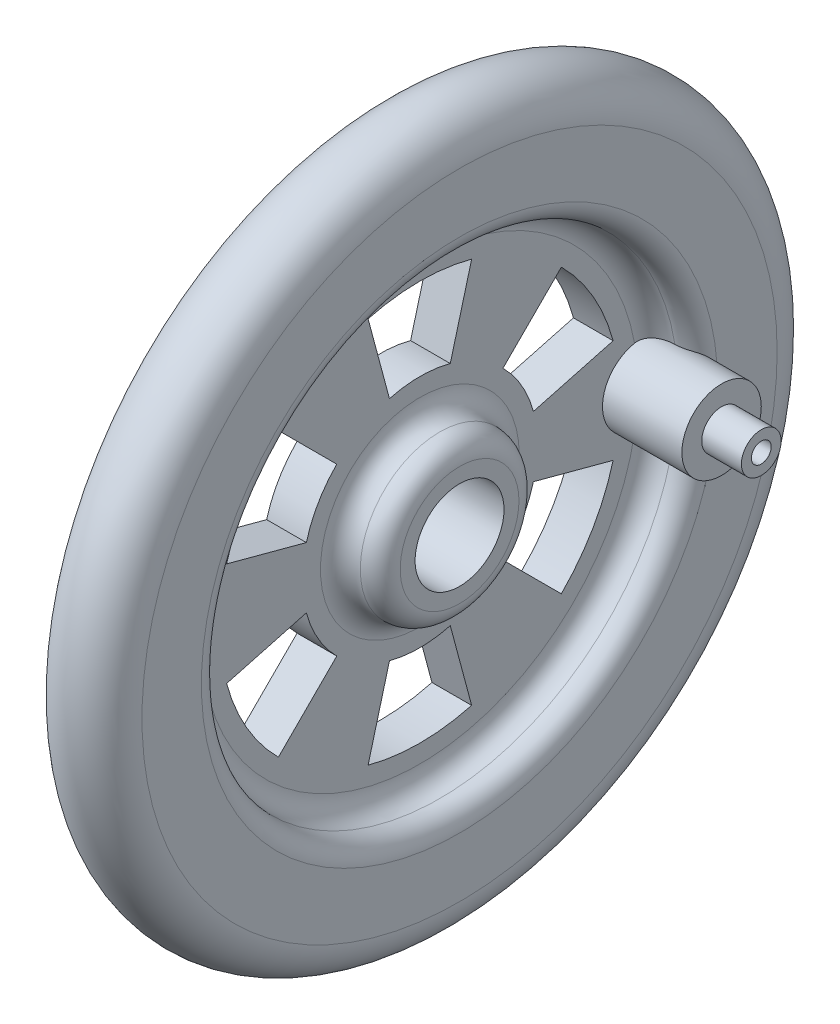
ISO-10303-21;
HEADER;
FILE_DESCRIPTION(('STEP AP214'),'2;1');
FILE_NAME('part.step','',(''),(''),'','','');
FILE_SCHEMA(('AUTOMOTIVE_DESIGN { 1 0 10303 214 1 1 1 1 }'));
ENDSEC;
DATA;
#1=APPLICATION_CONTEXT('core data for automotive mechanical design processes');
#2=APPLICATION_PROTOCOL_DEFINITION('international standard','automotive_design',2000,#1);
#3=PRODUCT_CONTEXT('',#1,'mechanical');
#4=PRODUCT('Part','Part','',(#3));
#5=PRODUCT_RELATED_PRODUCT_CATEGORY('part','',(#4));
#6=PRODUCT_DEFINITION_FORMATION('','',#4);
#7=PRODUCT_DEFINITION_CONTEXT('part definition',#1,'design');
#8=PRODUCT_DEFINITION('design','',#6,#7);
#9=PRODUCT_DEFINITION_SHAPE('','',#8);
#10=(LENGTH_UNIT() NAMED_UNIT(*) SI_UNIT(.MILLI.,.METRE.));
#11=(NAMED_UNIT(*) PLANE_ANGLE_UNIT() SI_UNIT($,.RADIAN.));
#12=(NAMED_UNIT(*) SI_UNIT($,.STERADIAN.) SOLID_ANGLE_UNIT());
#13=UNCERTAINTY_MEASURE_WITH_UNIT(LENGTH_MEASURE(1.E-05),#10,'distance_accuracy_value','');
#14=(GEOMETRIC_REPRESENTATION_CONTEXT(3) GLOBAL_UNCERTAINTY_ASSIGNED_CONTEXT((#13)) GLOBAL_UNIT_ASSIGNED_CONTEXT((#10,
#11,#12)) REPRESENTATION_CONTEXT('',''));
#15=CARTESIAN_POINT('',(0.,0.,0.));
#16=DIRECTION('',(0.,0.,1.));
#17=DIRECTION('',(1.,0.,0.));
#18=AXIS2_PLACEMENT_3D('',#15,#16,#17);
#19=CARTESIAN_POINT('',(9.525,0.,-17.78));
#20=DIRECTION('',(1.,0.,0.));
#21=DIRECTION('',(0.,0.,-1.));
#22=AXIS2_PLACEMENT_3D('',#19,#20,#21);
#23=PLANE('',#22);
#24=CARTESIAN_POINT('',(9.525,0.,-17.78));
#25=DIRECTION('',(1.,0.,0.));
#26=DIRECTION('',(0.,0.,-1.));
#27=AXIS2_PLACEMENT_3D('',#24,#25,#26);
#28=CIRCLE('',#27,3.175);
#29=CARTESIAN_POINT('',(9.525,0.,-20.955));
#30=VERTEX_POINT('',#29);
#31=EDGE_CURVE('E222',#30,#30,#28,.T.);
#32=ORIENTED_EDGE('',*,*,#31,.T.);
#33=EDGE_LOOP('',(#32));
#34=FACE_BOUND('',#33,.T.);
#35=CARTESIAN_POINT('',(9.525,0.,-17.78));
#36=DIRECTION('',(1.,0.,0.));
#37=DIRECTION('',(0.,0.,-1.));
#38=AXIS2_PLACEMENT_3D('',#35,#36,#37);
#39=CIRCLE('',#38,1.5875);
#40=CARTESIAN_POINT('',(9.525,0.,-19.3675));
#41=VERTEX_POINT('',#40);
#42=EDGE_CURVE('E509',#41,#41,#39,.T.);
#43=ORIENTED_EDGE('',*,*,#42,.F.);
#44=EDGE_LOOP('',(#43));
#45=FACE_BOUND('',#44,.T.);
#46=ADVANCED_FACE('F31',(#34,#45),#23,.T.);
#47=CARTESIAN_POINT('',(6.35,0.,0.));
#48=DIRECTION('',(1.,0.,0.));
#49=DIRECTION('',(0.,0.,-1.));
#50=AXIS2_PLACEMENT_3D('',#47,#48,#49);
#51=PLANE('',#50);
#52=CARTESIAN_POINT('',(6.35,0.,0.));
#53=DIRECTION('',(1.,0.,0.));
#54=DIRECTION('',(0.,0.,-1.));
#55=AXIS2_PLACEMENT_3D('',#52,#53,#54);
#56=CIRCLE('',#55,25.4);
#57=CARTESIAN_POINT('',(6.35,0.,-25.4));
#58=VERTEX_POINT('',#57);
#59=EDGE_CURVE('E474',#58,#58,#56,.T.);
#60=ORIENTED_EDGE('',*,*,#59,.T.);
#61=EDGE_LOOP('',(#60));
#62=FACE_BOUND('',#61,.T.);
#63=CARTESIAN_POINT('',(6.35,0.,0.));
#64=DIRECTION('',(1.,0.,0.));
#65=DIRECTION('',(0.,0.,-1.));
#66=AXIS2_PLACEMENT_3D('',#63,#64,#65);
#67=CIRCLE('',#66,20.650099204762);
#68=CARTESIAN_POINT('',(6.35,-1.46218893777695,-20.5982669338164));
#69=VERTEX_POINT('',#68);
#70=CARTESIAN_POINT('',(6.35,1.46218893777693,-20.5982669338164));
#71=VERTEX_POINT('',#70);
#72=EDGE_CURVE('E244',#69,#71,#67,.F.);
#73=ORIENTED_EDGE('',*,*,#72,.T.);
#74=CARTESIAN_POINT('',(6.35,0.,-17.78));
#75=DIRECTION('',(1.,0.,0.));
#76=DIRECTION('',(0.,0.,-1.));
#77=AXIS2_PLACEMENT_3D('',#74,#75,#76);
#78=CIRCLE('',#77,3.175);
#79=EDGE_CURVE('E51',#71,#69,#78,.F.);
#80=ORIENTED_EDGE('',*,*,#79,.T.);
#81=EDGE_LOOP('',(#73,#80));
#82=FACE_BOUND('',#81,.T.);
#83=ADVANCED_FACE('F497',(#62,#82),#51,.T.);
#84=CARTESIAN_POINT('',(3.175,0.,0.));
#85=DIRECTION('',(1.,0.,0.));
#86=DIRECTION('',(0.,0.,-1.));
#87=AXIS2_PLACEMENT_3D('',#84,#85,#86);
#88=PLANE('',#87);
#89=CARTESIAN_POINT('',(3.175,0.,0.));
#90=DIRECTION('',(1.,0.,0.));
#91=DIRECTION('',(0.,0.,-1.));
#92=AXIS2_PLACEMENT_3D('',#89,#90,#91);
#93=CIRCLE('',#92,7.95009920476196);
#94=CARTESIAN_POINT('',(3.175,0.,-7.95009920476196));
#95=VERTEX_POINT('',#94);
#96=EDGE_CURVE('E233',#95,#95,#93,.F.);
#97=ORIENTED_EDGE('',*,*,#96,.T.);
#98=EDGE_LOOP('',(#97));
#99=FACE_BOUND('',#98,.T.);
#100=CARTESIAN_POINT('',(3.175,0.,0.));
#101=DIRECTION('',(-1.,0.,0.));
#102=DIRECTION('',(0.,0.,-1.));
#103=AXIS2_PLACEMENT_3D('',#100,#101,#102);
#104=CIRCLE('',#103,9.398);
#105=CARTESIAN_POINT('',(3.175,6.64538952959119,-6.64538952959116));
#106=VERTEX_POINT('',#105);
#107=CARTESIAN_POINT('',(3.175,2.4323813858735,-9.07777091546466));
#108=VERTEX_POINT('',#107);
#109=EDGE_CURVE('E432',#106,#108,#104,.T.);
#110=ORIENTED_EDGE('',*,*,#109,.F.);
#111=DIRECTION('',(0.,-0.707106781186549,0.707106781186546));
#112=VECTOR('',#111,1.);
#113=CARTESIAN_POINT('',(3.175,6.64538952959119,-6.64538952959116));
#114=LINE('',#113,#112);
#115=CARTESIAN_POINT('',(3.175,11.3151227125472,-11.3151227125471));
#116=VERTEX_POINT('',#115);
#117=EDGE_CURVE('E443',#116,#106,#114,.T.);
#118=ORIENTED_EDGE('',*,*,#117,.F.);
#119=CARTESIAN_POINT('',(3.175,0.,0.));
#120=DIRECTION('',(1.,0.,0.));
#121=DIRECTION('',(0.,0.,-1.));
#122=AXIS2_PLACEMENT_3D('',#119,#120,#121);
#123=CIRCLE('',#122,16.002);
#124=CARTESIAN_POINT('',(3.175,4.14162235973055,-15.4567450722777));
#125=VERTEX_POINT('',#124);
#126=EDGE_CURVE('E457',#125,#116,#123,.T.);
#127=ORIENTED_EDGE('',*,*,#126,.F.);
#128=DIRECTION('',(0.,0.258819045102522,-0.965925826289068));
#129=VECTOR('',#128,1.);
#130=CARTESIAN_POINT('',(3.175,2.4323813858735,-9.07777091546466));
#131=LINE('',#130,#129);
#132=EDGE_CURVE('E454',#108,#125,#131,.T.);
#133=ORIENTED_EDGE('',*,*,#132,.F.);
#134=EDGE_LOOP('',(#110,#118,#127,#133));
#135=FACE_BOUND('',#134,.T.);
#136=CARTESIAN_POINT('',(3.175,0.,0.));
#137=DIRECTION('',(-1.,0.,0.));
#138=DIRECTION('',(0.,0.86602540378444,-0.499999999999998));
#139=AXIS2_PLACEMENT_3D('',#136,#137,#138);
#140=CIRCLE('',#139,9.398);
#141=CARTESIAN_POINT('',(3.175,9.07777091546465,2.43238138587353));
#142=VERTEX_POINT('',#141);
#143=CARTESIAN_POINT('',(3.175,9.07777091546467,-2.43238138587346));
#144=VERTEX_POINT('',#143);
#145=EDGE_CURVE('E400',#142,#144,#140,.T.);
#146=ORIENTED_EDGE('',*,*,#145,.F.);
#147=DIRECTION('',(0.,-0.965925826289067,-0.258819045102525));
#148=VECTOR('',#147,1.);
#149=CARTESIAN_POINT('',(3.175,9.07777091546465,2.43238138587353));
#150=LINE('',#149,#148);
#151=CARTESIAN_POINT('',(3.175,15.4567450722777,4.14162235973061));
#152=VERTEX_POINT('',#151);
#153=EDGE_CURVE('E411',#152,#142,#150,.T.);
#154=ORIENTED_EDGE('',*,*,#153,.F.);
#155=CARTESIAN_POINT('',(3.175,0.,0.));
#156=DIRECTION('',(1.,0.,0.));
#157=DIRECTION('',(0.,0.86602540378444,-0.499999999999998));
#158=AXIS2_PLACEMENT_3D('',#155,#156,#157);
#159=CIRCLE('',#158,16.002);
#160=CARTESIAN_POINT('',(3.175,15.4567450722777,-4.14162235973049));
#161=VERTEX_POINT('',#160);
#162=EDGE_CURVE('E425',#161,#152,#159,.T.);
#163=ORIENTED_EDGE('',*,*,#162,.F.);
#164=DIRECTION('',(0.,0.965925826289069,-0.258819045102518));
#165=VECTOR('',#164,1.);
#166=CARTESIAN_POINT('',(3.175,9.07777091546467,-2.43238138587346));
#167=LINE('',#166,#165);
#168=EDGE_CURVE('E422',#144,#161,#167,.T.);
#169=ORIENTED_EDGE('',*,*,#168,.F.);
#170=EDGE_LOOP('',(#146,#154,#163,#169));
#171=FACE_BOUND('',#170,.T.);
#172=CARTESIAN_POINT('',(3.175,0.,0.));
#173=DIRECTION('',(-1.,0.,0.));
#174=DIRECTION('',(0.,0.866025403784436,0.500000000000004));
#175=AXIS2_PLACEMENT_3D('',#172,#173,#174);
#176=CIRCLE('',#175,9.398);
#177=CARTESIAN_POINT('',(3.175,2.43238138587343,9.07777091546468));
#178=VERTEX_POINT('',#177);
#179=CARTESIAN_POINT('',(3.175,6.64538952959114,6.64538952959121));
#180=VERTEX_POINT('',#179);
#181=EDGE_CURVE('E368',#178,#180,#176,.T.);
#182=ORIENTED_EDGE('',*,*,#181,.F.);
#183=DIRECTION('',(0.,-0.258819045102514,-0.96592582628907));
#184=VECTOR('',#183,1.);
#185=CARTESIAN_POINT('',(3.175,2.43238138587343,9.07777091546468));
#186=LINE('',#185,#184);
#187=CARTESIAN_POINT('',(3.175,4.14162235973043,15.4567450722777));
#188=VERTEX_POINT('',#187);
#189=EDGE_CURVE('E379',#188,#178,#186,.T.);
#190=ORIENTED_EDGE('',*,*,#189,.F.);
#191=CARTESIAN_POINT('',(3.175,0.,0.));
#192=DIRECTION('',(1.,0.,0.));
#193=DIRECTION('',(0.,0.866025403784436,0.500000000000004));
#194=AXIS2_PLACEMENT_3D('',#191,#192,#193);
#195=CIRCLE('',#194,16.002);
#196=CARTESIAN_POINT('',(3.175,11.3151227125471,11.3151227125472));
#197=VERTEX_POINT('',#196);
#198=EDGE_CURVE('E393',#197,#188,#195,.T.);
#199=ORIENTED_EDGE('',*,*,#198,.F.);
#200=DIRECTION('',(0.,0.707106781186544,0.707106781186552));
#201=VECTOR('',#200,1.);
#202=CARTESIAN_POINT('',(3.175,6.64538952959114,6.64538952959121));
#203=LINE('',#202,#201);
#204=EDGE_CURVE('E390',#180,#197,#203,.T.);
#205=ORIENTED_EDGE('',*,*,#204,.F.);
#206=EDGE_LOOP('',(#182,#190,#199,#205));
#207=FACE_BOUND('',#206,.T.);
#208=CARTESIAN_POINT('',(3.175,0.,0.));
#209=DIRECTION('',(-1.,0.,0.));
#210=DIRECTION('',(0.,0.,1.));
#211=AXIS2_PLACEMENT_3D('',#208,#209,#210);
#212=CIRCLE('',#211,9.398);
#213=CARTESIAN_POINT('',(3.175,-6.64538952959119,6.64538952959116));
#214=VERTEX_POINT('',#213);
#215=CARTESIAN_POINT('',(3.175,-2.4323813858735,9.07777091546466));
#216=VERTEX_POINT('',#215);
#217=EDGE_CURVE('E336',#214,#216,#212,.T.);
#218=ORIENTED_EDGE('',*,*,#217,.F.);
#219=DIRECTION('',(0.,0.707106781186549,-0.707106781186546));
#220=VECTOR('',#219,1.);
#221=CARTESIAN_POINT('',(3.175,-6.64538952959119,6.64538952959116));
#222=LINE('',#221,#220);
#223=CARTESIAN_POINT('',(3.175,-11.3151227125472,11.3151227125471));
#224=VERTEX_POINT('',#223);
#225=EDGE_CURVE('E347',#224,#214,#222,.T.);
#226=ORIENTED_EDGE('',*,*,#225,.F.);
#227=CARTESIAN_POINT('',(3.175,0.,0.));
#228=DIRECTION('',(1.,0.,0.));
#229=DIRECTION('',(0.,0.,1.));
#230=AXIS2_PLACEMENT_3D('',#227,#228,#229);
#231=CIRCLE('',#230,16.002);
#232=CARTESIAN_POINT('',(3.175,-4.14162235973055,15.4567450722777));
#233=VERTEX_POINT('',#232);
#234=EDGE_CURVE('E361',#233,#224,#231,.T.);
#235=ORIENTED_EDGE('',*,*,#234,.F.);
#236=DIRECTION('',(0.,-0.258819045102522,0.965925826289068));
#237=VECTOR('',#236,1.);
#238=CARTESIAN_POINT('',(3.175,-2.4323813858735,9.07777091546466));
#239=LINE('',#238,#237);
#240=EDGE_CURVE('E358',#216,#233,#239,.T.);
#241=ORIENTED_EDGE('',*,*,#240,.F.);
#242=EDGE_LOOP('',(#218,#226,#235,#241));
#243=FACE_BOUND('',#242,.T.);
#244=CARTESIAN_POINT('',(3.175,0.,0.));
#245=DIRECTION('',(-1.,0.,0.));
#246=DIRECTION('',(0.,-0.866025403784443,0.499999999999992));
#247=AXIS2_PLACEMENT_3D('',#244,#245,#246);
#248=CIRCLE('',#247,9.398);
#249=CARTESIAN_POINT('',(3.175,-9.07777091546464,-2.43238138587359));
#250=VERTEX_POINT('',#249);
#251=CARTESIAN_POINT('',(3.175,-9.07777091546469,2.4323813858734));
#252=VERTEX_POINT('',#251);
#253=EDGE_CURVE('E304',#250,#252,#248,.T.);
#254=ORIENTED_EDGE('',*,*,#253,.F.);
#255=DIRECTION('',(0.,0.965925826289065,0.258819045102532));
#256=VECTOR('',#255,1.);
#257=CARTESIAN_POINT('',(3.175,-9.07777091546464,-2.43238138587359));
#258=LINE('',#257,#256);
#259=CARTESIAN_POINT('',(3.175,-15.4567450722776,-4.14162235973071));
#260=VERTEX_POINT('',#259);
#261=EDGE_CURVE('E315',#260,#250,#258,.T.);
#262=ORIENTED_EDGE('',*,*,#261,.F.);
#263=CARTESIAN_POINT('',(3.175,0.,0.));
#264=DIRECTION('',(1.,0.,0.));
#265=DIRECTION('',(0.,-0.866025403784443,0.499999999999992));
#266=AXIS2_PLACEMENT_3D('',#263,#264,#265);
#267=CIRCLE('',#266,16.002);
#268=CARTESIAN_POINT('',(3.175,-15.4567450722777,4.14162235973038));
#269=VERTEX_POINT('',#268);
#270=EDGE_CURVE('E329',#269,#260,#267,.T.);
#271=ORIENTED_EDGE('',*,*,#270,.F.);
#272=DIRECTION('',(0.,-0.965925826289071,0.258819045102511));
#273=VECTOR('',#272,1.);
#274=CARTESIAN_POINT('',(3.175,-9.07777091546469,2.4323813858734));
#275=LINE('',#274,#273);
#276=EDGE_CURVE('E326',#252,#269,#275,.T.);
#277=ORIENTED_EDGE('',*,*,#276,.F.);
#278=EDGE_LOOP('',(#254,#262,#271,#277));
#279=FACE_BOUND('',#278,.T.);
#280=CARTESIAN_POINT('',(3.175,0.,0.));
#281=DIRECTION('',(-1.,0.,0.));
#282=DIRECTION('',(0.,-0.866025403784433,-0.50000000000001));
#283=AXIS2_PLACEMENT_3D('',#280,#281,#282);
#284=CIRCLE('',#283,9.398);
#285=CARTESIAN_POINT('',(3.175,-2.43238138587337,-9.0777709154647));
#286=VERTEX_POINT('',#285);
#287=CARTESIAN_POINT('',(3.175,-6.64538952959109,-6.64538952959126));
#288=VERTEX_POINT('',#287);
#289=EDGE_CURVE('E280',#286,#288,#284,.T.);
#290=ORIENTED_EDGE('',*,*,#289,.F.);
#291=DIRECTION('',(0.,0.258819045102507,0.965925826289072));
#292=VECTOR('',#291,1.);
#293=CARTESIAN_POINT('',(3.175,-2.43238138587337,-9.0777709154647));
#294=LINE('',#293,#292);
#295=CARTESIAN_POINT('',(3.175,-4.14162235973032,-15.4567450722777));
#296=VERTEX_POINT('',#295);
#297=EDGE_CURVE('E285',#296,#286,#294,.T.);
#298=ORIENTED_EDGE('',*,*,#297,.F.);
#299=CARTESIAN_POINT('',(3.175,0.,0.));
#300=DIRECTION('',(1.,0.,0.));
#301=DIRECTION('',(0.,-0.866025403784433,-0.50000000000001));
#302=AXIS2_PLACEMENT_3D('',#299,#300,#301);
#303=CIRCLE('',#302,16.002);
#304=CARTESIAN_POINT('',(3.175,-11.315122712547,-11.3151227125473));
#305=VERTEX_POINT('',#304);
#306=EDGE_CURVE('E297',#305,#296,#303,.T.);
#307=ORIENTED_EDGE('',*,*,#306,.F.);
#308=DIRECTION('',(0.,-0.707106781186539,-0.707106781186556));
#309=VECTOR('',#308,1.);
#310=CARTESIAN_POINT('',(3.175,-6.64538952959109,-6.64538952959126));
#311=LINE('',#310,#309);
#312=EDGE_CURVE('E294',#288,#305,#311,.T.);
#313=ORIENTED_EDGE('',*,*,#312,.F.);
#314=EDGE_LOOP('',(#290,#298,#307,#313));
#315=FACE_BOUND('',#314,.T.);
#316=CARTESIAN_POINT('',(3.175,0.,0.));
#317=DIRECTION('',(1.,0.,0.));
#318=DIRECTION('',(0.,0.,-1.));
#319=AXIS2_PLACEMENT_3D('',#316,#317,#318);
#320=CIRCLE('',#319,17.4498);
#321=CARTESIAN_POINT('',(3.175,3.11572994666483,-17.169384));
#322=VERTEX_POINT('',#321);
#323=CARTESIAN_POINT('',(3.175,-3.11572994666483,-17.169384));
#324=VERTEX_POINT('',#323);
#325=EDGE_CURVE('E227',#322,#324,#320,.T.);
#326=ORIENTED_EDGE('',*,*,#325,.T.);
#327=CARTESIAN_POINT('',(3.175,0.,-17.78));
#328=DIRECTION('',(1.,0.,0.));
#329=DIRECTION('',(0.,0.,-1.));
#330=AXIS2_PLACEMENT_3D('',#327,#328,#329);
#331=CIRCLE('',#330,3.175);
#332=EDGE_CURVE('E216',#322,#324,#331,.T.);
#333=ORIENTED_EDGE('',*,*,#332,.F.);
#334=EDGE_LOOP('',(#326,#333));
#335=FACE_BOUND('',#334,.T.);
#336=ADVANCED_FACE('F226',(#99,#135,#171,#207,#243,#279,#315,#335),#88,.T.);
#337=CARTESIAN_POINT('',(4.7752,0.,0.));
#338=DIRECTION('',(1.,0.,0.));
#339=DIRECTION('',(0.,0.,-1.));
#340=AXIS2_PLACEMENT_3D('',#337,#338,#339);
#341=TOROIDAL_SURFACE('',#340,17.4498,1.6002);
#342=CARTESIAN_POINT('',(4.7627,3.00265997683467,-18.8118226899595));
#343=CARTESIAN_POINT('',(4.72032530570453,3.00277457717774,-18.8114717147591));
#344=CARTESIAN_POINT('',(4.67799139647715,3.00352425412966,-18.8093089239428));
#345=CARTESIAN_POINT('',(4.5937183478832,3.00621958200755,-18.8014175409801));
#346=CARTESIAN_POINT('',(4.55177900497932,3.00816457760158,-18.795690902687));
#347=CARTESIAN_POINT('',(4.4274510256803,3.01565265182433,-18.7733379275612));
#348=CARTESIAN_POINT('',(4.34603796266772,3.02285203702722,-18.7515327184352));
#349=CARTESIAN_POINT('',(4.18835038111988,3.04036971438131,-18.6952216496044));
#350=CARTESIAN_POINT('',(4.1120672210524,3.05068259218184,-18.6607378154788));
#351=CARTESIAN_POINT('',(3.96589693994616,3.07274951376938,-18.5803568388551));
#352=CARTESIAN_POINT('',(3.89601870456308,3.08450550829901,-18.5344441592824));
#353=CARTESIAN_POINT('',(3.75922459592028,3.10848665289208,-18.4288951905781));
#354=CARTESIAN_POINT('',(3.69288148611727,3.12068489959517,-18.3685103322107));
#355=CARTESIAN_POINT('',(3.5703504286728,3.14252523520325,-18.2377682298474));
#356=CARTESIAN_POINT('',(3.51416483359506,3.1521667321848,-18.1674086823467));
#357=CARTESIAN_POINT('',(3.41073240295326,3.16729887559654,-18.0145785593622));
#358=CARTESIAN_POINT('',(3.36408827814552,3.17255250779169,-17.9316730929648));
#359=CARTESIAN_POINT('',(3.28524572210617,3.17610052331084,-17.7591119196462));
#360=CARTESIAN_POINT('',(3.25303800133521,3.17439938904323,-17.6694605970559));
#361=CARTESIAN_POINT('',(3.20631421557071,3.16315119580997,-17.4930521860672));
#362=CARTESIAN_POINT('',(3.19068896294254,3.15417932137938,-17.406553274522));
#363=CARTESIAN_POINT('',(3.17391631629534,3.12879411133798,-17.2332593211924));
#364=CARTESIAN_POINT('',(3.17276138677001,3.1123846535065,-17.1464644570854));
#365=CARTESIAN_POINT('',(3.18444005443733,3.07421210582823,-16.9822545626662));
#366=CARTESIAN_POINT('',(3.19618498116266,3.05296906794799,-16.9046373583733));
#367=CARTESIAN_POINT('',(3.23138364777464,3.00558955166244,-16.753687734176));
#368=CARTESIAN_POINT('',(3.25483846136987,2.97945262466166,-16.6803557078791));
#369=CARTESIAN_POINT('',(3.31319780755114,2.9229684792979,-16.5378653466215));
#370=CARTESIAN_POINT('',(3.34836167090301,2.89253582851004,-16.4688479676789));
#371=CARTESIAN_POINT('',(3.42880816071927,2.82960540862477,-16.338044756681));
#372=CARTESIAN_POINT('',(3.47409475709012,2.79710683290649,-16.2762617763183));
#373=CARTESIAN_POINT('',(3.57894640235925,2.72835139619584,-16.1545434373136));
#374=CARTESIAN_POINT('',(3.6395136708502,2.69205968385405,-16.095490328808));
#375=CARTESIAN_POINT('',(3.77045002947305,2.62157408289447,-15.9877588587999));
#376=CARTESIAN_POINT('',(3.84083044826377,2.58738268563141,-15.939092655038));
#377=CARTESIAN_POINT('',(3.99536181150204,2.52167452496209,-15.8499594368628));
#378=CARTESIAN_POINT('',(4.08012879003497,2.49050683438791,-15.810293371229));
#379=CARTESIAN_POINT('',(4.25751581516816,2.43753463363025,-15.7450958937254));
#380=CARTESIAN_POINT('',(4.35010991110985,2.41570053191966,-15.7195197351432));
#381=CARTESIAN_POINT('',(4.49697766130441,2.39174214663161,-15.6918524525));
#382=CARTESIAN_POINT('',(4.54956820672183,2.38516995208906,-15.6843708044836));
#383=CARTESIAN_POINT('',(4.65564335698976,2.37609513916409,-15.6740991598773));
#384=CARTESIAN_POINT('',(4.709129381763,2.37359975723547,-15.6713175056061));
#385=CARTESIAN_POINT('',(4.7627,2.37329984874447,-15.6709545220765));
#386=B_SPLINE_CURVE_WITH_KNOTS('',3,(#342,#343,#344,#345,#346,#347,#348,#349,#350,#351,#352,
#353,#354,#355,#356,#357,#358,#359,#360,#361,#362,#363,#364,#365,#366,#367,#368,#369,#370,#371,
#372,#373,#374,#375,#376,#377,#378,#379,#380,#381,#382,#383,#384,#385),.UNSPECIFIED.,.F.,.F.,(4,
2,2,2,2,2,2,2,2,2,2,2,2,2,2,2,2,2,2,2,2,4),(0.,0.127040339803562,0.254011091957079,
0.506430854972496,0.758414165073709,1.01074192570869,1.2811834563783,1.55168754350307,
1.83600015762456,2.12012955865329,2.38375039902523,2.64723395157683,2.89007816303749,
3.1329446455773,3.3815940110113,3.63034106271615,3.90532534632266,4.18062975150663,
4.47499480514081,4.76841954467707,4.92865854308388,5.08918166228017),.UNSPECIFIED.);
#387=CARTESIAN_POINT('',(4.7625,3.00266055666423,-18.8118210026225));
#388=VERTEX_POINT('',#387);
#389=EDGE_CURVE('E213',#388,#322,#386,.T.);
#390=ORIENTED_EDGE('',*,*,#389,.F.);
#391=CARTESIAN_POINT('',(4.7625,0.,0.));
#392=DIRECTION('',(1.,0.,0.));
#393=DIRECTION('',(0.,0.,-1.));
#394=AXIS2_PLACEMENT_3D('',#391,#392,#393);
#395=CIRCLE('',#394,19.049949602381);
#396=CARTESIAN_POINT('',(4.7625,-3.00266055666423,-18.8118210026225));
#397=VERTEX_POINT('',#396);
#398=EDGE_CURVE('E236',#388,#397,#395,.T.);
#399=ORIENTED_EDGE('',*,*,#398,.T.);
#400=CARTESIAN_POINT('',(4.7627,-2.37329984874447,-15.6709545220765));
#401=CARTESIAN_POINT('',(4.72122697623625,-2.37354630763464,-15.6712406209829));
#402=CARTESIAN_POINT('',(4.6797973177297,-2.3750914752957,-15.6729700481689));
#403=CARTESIAN_POINT('',(4.59735539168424,-2.38066993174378,-15.6792712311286));
#404=CARTESIAN_POINT('',(4.55634282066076,-2.38470125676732,-15.6838407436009));
#405=CARTESIAN_POINT('',(4.43494061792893,-2.400285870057,-15.7016571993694));
#406=CARTESIAN_POINT('',(4.35555303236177,-2.4153370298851,-15.7190179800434));
#407=CARTESIAN_POINT('',(4.20195560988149,-2.45293664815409,-15.7639228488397));
#408=CARTESIAN_POINT('',(4.1277320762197,-2.47546428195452,-15.7914386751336));
#409=CARTESIAN_POINT('',(3.98534093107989,-2.52590882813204,-15.8559193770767));
#410=CARTESIAN_POINT('',(3.91718515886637,-2.55383595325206,-15.8929022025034));
#411=CARTESIAN_POINT('',(3.78146239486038,-2.61595602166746,-15.9798526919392));
#412=CARTESIAN_POINT('',(3.71465428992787,-2.65049710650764,-16.0307561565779));
#413=CARTESIAN_POINT('',(3.59082537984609,-2.72098009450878,-16.1425444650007));
#414=CARTESIAN_POINT('',(3.53380711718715,-2.75692235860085,-16.2034318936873));
#415=CARTESIAN_POINT('',(3.42659113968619,-2.83077634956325,-16.3399210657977));
#416=CARTESIAN_POINT('',(3.37734426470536,-2.86860590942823,-16.4163223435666));
#417=CARTESIAN_POINT('',(3.29377437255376,-2.94025527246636,-16.5785983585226));
#418=CARTESIAN_POINT('',(3.25944100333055,-2.97407784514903,-16.6644664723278));
#419=CARTESIAN_POINT('',(3.20956124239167,-3.03273616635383,-16.8362274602));
#420=CARTESIAN_POINT('',(3.19273963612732,-3.05807223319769,-16.921577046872));
#421=CARTESIAN_POINT('',(3.17423479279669,-3.10166270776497,-17.0956444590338));
#422=CARTESIAN_POINT('',(3.17254181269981,-3.11992166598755,-17.1843600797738));
#423=CARTESIAN_POINT('',(3.18384022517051,-3.14726583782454,-17.3534207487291));
#424=CARTESIAN_POINT('',(3.19543289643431,-3.15706527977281,-17.4337489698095));
#425=CARTESIAN_POINT('',(3.23057758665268,-3.17044271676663,-17.592263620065));
#426=CARTESIAN_POINT('',(3.25413008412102,-3.1740204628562,-17.6704499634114));
#427=CARTESIAN_POINT('',(3.31261260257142,-3.17563501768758,-17.8233984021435));
#428=CARTESIAN_POINT('',(3.34765777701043,-3.17361413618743,-17.898116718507));
#429=CARTESIAN_POINT('',(3.42797547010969,-3.16502586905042,-18.041544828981));
#430=CARTESIAN_POINT('',(3.47325166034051,-3.15845684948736,-18.1102524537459));
#431=CARTESIAN_POINT('',(3.57743290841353,-3.14141692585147,-18.2460670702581));
#432=CARTESIAN_POINT('',(3.63719540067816,-3.13064926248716,-18.3124796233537));
#433=CARTESIAN_POINT('',(3.76633138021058,-3.10734600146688,-18.4349188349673));
#434=CARTESIAN_POINT('',(3.83571223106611,-3.09480904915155,-18.4909374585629));
#435=CARTESIAN_POINT('',(3.98710578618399,-3.06938569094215,-18.5939274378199));
#436=CARTESIAN_POINT('',(4.06962277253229,-3.05652244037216,-18.6401681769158));
#437=CARTESIAN_POINT('',(4.24190164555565,-3.03381743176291,-18.7171242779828));
#438=CARTESIAN_POINT('',(4.33164788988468,-3.02396936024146,-18.7478721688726));
#439=CARTESIAN_POINT('',(4.47896976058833,-3.01232455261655,-18.7833561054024));
#440=CARTESIAN_POINT('',(4.53513913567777,-3.00888339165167,-18.7935740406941));
#441=CARTESIAN_POINT('',(4.64841132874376,-3.0041181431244,-18.8075806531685));
#442=CARTESIAN_POINT('',(4.70551495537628,-3.00279599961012,-18.8113634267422));
#443=CARTESIAN_POINT('',(4.7627,-3.00265997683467,-18.8118226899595));
#444=B_SPLINE_CURVE_WITH_KNOTS('',3,(#400,#401,#402,#403,#404,#405,#406,#407,#408,#409,#410,
#411,#412,#413,#414,#415,#416,#417,#418,#419,#420,#421,#422,#423,#424,#425,#426,#427,#428,#429,
#430,#431,#432,#433,#434,#435,#436,#437,#438,#439,#440,#441,#442,#443),.UNSPECIFIED.,.F.,.F.,(4,
2,2,2,2,2,2,2,2,2,2,2,2,2,2,2,2,2,2,2,2,4),(0.,0.12433186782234,0.248565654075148,
0.495160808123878,0.741074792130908,0.987458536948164,1.25879838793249,1.53020860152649,
1.82401123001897,2.11760959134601,2.3878967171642,2.65800976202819,2.90210496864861,
3.14620994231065,3.39283958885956,3.6395578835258,3.90837195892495,4.17739298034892,
4.46231761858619,4.74664150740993,4.91784799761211,5.08921146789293),.UNSPECIFIED.);
#445=EDGE_CURVE('E231',#324,#397,#444,.T.);
#446=ORIENTED_EDGE('',*,*,#445,.F.);
#447=ORIENTED_EDGE('',*,*,#325,.F.);
#448=EDGE_LOOP('',(#390,#399,#446,#447));
#449=FACE_BOUND('',#448,.T.);
#450=ADVANCED_FACE('F230',(#449),#341,.F.);
#451=CARTESIAN_POINT('',(4.7498,0.,0.));
#452=DIRECTION('',(1.,0.,0.));
#453=DIRECTION('',(0.,0.,-1.));
#454=AXIS2_PLACEMENT_3D('',#451,#452,#453);
#455=TOROIDAL_SURFACE('',#454,20.650099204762,1.6002);
#456=ORIENTED_EDGE('',*,*,#72,.F.);
#457=CARTESIAN_POINT('',(6.3493741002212,-1.35720576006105,-20.650299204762));
#458=CARTESIAN_POINT('',(6.35005417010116,-1.4179662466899,-20.6215741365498));
#459=CARTESIAN_POINT('',(6.35023071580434,-1.47782450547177,-20.5909046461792));
#460=CARTESIAN_POINT('',(6.34903006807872,-1.59551596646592,-20.5258100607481));
#461=CARTESIAN_POINT('',(6.34765145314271,-1.65334726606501,-20.4913815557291));
#462=CARTESIAN_POINT('',(6.34277003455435,-1.7671301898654,-20.4186496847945));
#463=CARTESIAN_POINT('',(6.33924940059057,-1.82306182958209,-20.3803160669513));
#464=CARTESIAN_POINT('',(6.32943290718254,-1.93217684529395,-20.3002974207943));
#465=CARTESIAN_POINT('',(6.32313810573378,-1.98536126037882,-20.2586136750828));
#466=CARTESIAN_POINT('',(6.30147578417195,-2.12477071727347,-20.1419953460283));
#467=CARTESIAN_POINT('',(6.28284236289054,-2.20814703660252,-20.064159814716));
#468=CARTESIAN_POINT('',(6.23198699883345,-2.36387331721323,-19.9025544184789));
#469=CARTESIAN_POINT('',(6.19981751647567,-2.43626439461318,-19.8188084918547));
#470=CARTESIAN_POINT('',(6.12614176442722,-2.55596870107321,-19.6655396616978));
#471=CARTESIAN_POINT('',(6.08754361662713,-2.60543635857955,-19.5963155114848));
#472=CARTESIAN_POINT('',(5.99784390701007,-2.69534177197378,-19.4600041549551));
#473=CARTESIAN_POINT('',(5.94674189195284,-2.73577920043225,-19.3929170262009));
#474=CARTESIAN_POINT('',(5.83143579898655,-2.80755484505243,-19.264492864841));
#475=CARTESIAN_POINT('',(5.76715335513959,-2.83883578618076,-19.2031935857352));
#476=CARTESIAN_POINT('',(5.62679666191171,-2.89238131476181,-19.0909700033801));
#477=CARTESIAN_POINT('',(5.55072503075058,-2.91464790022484,-19.0400434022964));
#478=CARTESIAN_POINT('',(5.39828982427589,-2.94909415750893,-18.9569742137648));
#479=CARTESIAN_POINT('',(5.32290859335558,-2.96212289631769,-18.9233686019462));
#480=CARTESIAN_POINT('',(5.16702335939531,-2.98261234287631,-18.8688103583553));
#481=CARTESIAN_POINT('',(5.08652541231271,-2.99007950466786,-18.8478430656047));
#482=CARTESIAN_POINT('',(4.96475780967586,-2.99749598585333,-18.8267520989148));
#483=CARTESIAN_POINT('',(4.92442863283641,-2.99933717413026,-18.8214518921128));
#484=CARTESIAN_POINT('',(4.84351153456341,-3.00185792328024,-18.8141582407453));
#485=CARTESIAN_POINT('',(4.80292422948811,-3.00253962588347,-18.8121586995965));
#486=CARTESIAN_POINT('',(4.7623,-3.00266113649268,-18.8118193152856));
#487=B_SPLINE_CURVE_WITH_KNOTS('',3,(#457,#458,#459,#460,#461,#462,#463,#464,#465,#466,#467,
#468,#469,#470,#471,#472,#473,#474,#475,#476,#477,#478,#479,#480,#481,#482,#483,#484,#485,#486),
.UNSPECIFIED.,.F.,.F.,(4,2,2,2,2,2,2,2,2,2,2,2,2,2,4),(0.,0.201614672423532,0.403413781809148,
0.606916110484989,0.810340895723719,1.15575331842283,1.49983921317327,1.77898345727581,
2.05813782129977,2.33900274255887,2.61980537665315,2.86923266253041,3.11837004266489,
3.24039281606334,3.36218995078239),.UNSPECIFIED.);
#488=EDGE_CURVE('E11',#69,#397,#487,.T.);
#489=ORIENTED_EDGE('',*,*,#488,.T.);
#490=ORIENTED_EDGE('',*,*,#398,.F.);
#491=CARTESIAN_POINT('',(4.7623,3.00266113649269,-18.8118193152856));
#492=CARTESIAN_POINT('',(4.80226803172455,3.00254191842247,-18.8121526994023));
#493=CARTESIAN_POINT('',(4.84220176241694,3.00187997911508,-18.8140938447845));
#494=CARTESIAN_POINT('',(4.92174959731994,2.99943858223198,-18.8211592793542));
#495=CARTESIAN_POINT('',(4.96136372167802,2.99765919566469,-18.8262833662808));
#496=CARTESIAN_POINT('',(5.07917567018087,2.99060753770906,-18.8463508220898));
#497=CARTESIAN_POINT('',(5.15653046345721,2.98362150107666,-18.8659912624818));
#498=CARTESIAN_POINT('',(5.30662910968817,2.96457207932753,-18.9169556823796));
#499=CARTESIAN_POINT('',(5.37937040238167,2.95250590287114,-18.9482860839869));
#500=CARTESIAN_POINT('',(5.51823419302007,2.92262151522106,-19.0211490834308));
#501=CARTESIAN_POINT('',(5.58435874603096,2.90480509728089,-19.0626784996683));
#502=CARTESIAN_POINT('',(5.70880970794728,2.86265758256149,-19.1541756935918));
#503=CARTESIAN_POINT('',(5.76708511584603,2.83828669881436,-19.2041942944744));
#504=CARTESIAN_POINT('',(5.87439817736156,2.78268517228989,-19.3099849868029));
#505=CARTESIAN_POINT('',(5.92343259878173,2.75145213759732,-19.3657590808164));
#506=CARTESIAN_POINT('',(6.01460811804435,2.68007919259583,-19.483767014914));
#507=CARTESIAN_POINT('',(6.05617973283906,2.63952577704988,-19.5461878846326));
#508=CARTESIAN_POINT('',(6.12927418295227,2.55109580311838,-19.6716731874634));
#509=CARTESIAN_POINT('',(6.16079509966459,2.50321784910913,-19.7347377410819));
#510=CARTESIAN_POINT('',(6.20749599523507,2.41492189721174,-19.8420871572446));
#511=CARTESIAN_POINT('',(6.22478623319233,2.37606801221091,-19.8867715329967));
#512=CARTESIAN_POINT('',(6.25524340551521,2.29515994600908,-19.9746386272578));
#513=CARTESIAN_POINT('',(6.26840868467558,2.25310448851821,-20.0178207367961));
#514=CARTESIAN_POINT('',(6.30262698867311,2.12230951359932,-20.1445608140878));
#515=CARTESIAN_POINT('',(6.31830270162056,2.02914432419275,-20.2250634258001));
#516=CARTESIAN_POINT('',(6.33876291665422,1.84205358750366,-20.3684674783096));
#517=CARTESIAN_POINT('',(6.3443805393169,1.74890819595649,-20.4322927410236));
#518=CARTESIAN_POINT('',(6.3487788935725,1.60483154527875,-20.5201233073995));
#519=CARTESIAN_POINT('',(6.34957810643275,1.55626959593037,-20.5479924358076));
#520=CARTESIAN_POINT('',(6.35016116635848,1.4577518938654,-20.6011196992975));
#521=CARTESIAN_POINT('',(6.34994535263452,1.407796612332,-20.6263787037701));
#522=CARTESIAN_POINT('',(6.3493741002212,1.35720576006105,-20.650299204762));
#523=B_SPLINE_CURVE_WITH_KNOTS('',3,(#491,#492,#493,#494,#495,#496,#497,#498,#499,#500,#501,
#502,#503,#504,#505,#506,#507,#508,#509,#510,#511,#512,#513,#514,#515,#516,#517,#518,#519,#520,
#521,#522),.UNSPECIFIED.,.F.,.F.,(4,2,2,2,2,2,2,2,2,2,2,2,2,2,2,4),(0.,0.11983448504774,
0.23966135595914,0.478760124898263,0.717990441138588,0.957146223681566,1.19778784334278,
1.43851347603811,1.69329134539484,1.94811782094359,2.13293686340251,2.31782997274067,
2.68861265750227,3.02694472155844,3.19485691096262,3.36271298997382),.UNSPECIFIED.);
#524=EDGE_CURVE('E44',#388,#71,#523,.T.);
#525=ORIENTED_EDGE('',*,*,#524,.T.);
#526=EDGE_LOOP('',(#456,#489,#490,#525));
#527=FACE_BOUND('',#526,.T.);
#528=ADVANCED_FACE('F33',(#527),#455,.T.);
#529=CARTESIAN_POINT('',(0.,0.,0.));
#530=DIRECTION('',(-1.,0.,0.));
#531=DIRECTION('',(0.,0.,1.));
#532=AXIS2_PLACEMENT_3D('',#529,#530,#531);
#533=PLANE('',#532);
#534=CARTESIAN_POINT('',(0.,0.,0.));
#535=DIRECTION('',(-1.,0.,0.));
#536=DIRECTION('',(0.,-0.866025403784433,-0.50000000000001));
#537=AXIS2_PLACEMENT_3D('',#534,#535,#536);
#538=CIRCLE('',#537,9.398);
#539=CARTESIAN_POINT('',(0.,-2.43238138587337,-9.0777709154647));
#540=VERTEX_POINT('',#539);
#541=CARTESIAN_POINT('',(0.,-6.64538952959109,-6.64538952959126));
#542=VERTEX_POINT('',#541);
#543=EDGE_CURVE('E281',#540,#542,#538,.T.);
#544=ORIENTED_EDGE('',*,*,#543,.T.);
#545=DIRECTION('',(0.,-0.707106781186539,-0.707106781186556));
#546=VECTOR('',#545,1.);
#547=CARTESIAN_POINT('',(0.,-6.64538952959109,-6.64538952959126));
#548=LINE('',#547,#546);
#549=CARTESIAN_POINT('',(0.,-11.315122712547,-11.3151227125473));
#550=VERTEX_POINT('',#549);
#551=EDGE_CURVE('E284',#542,#550,#548,.T.);
#552=ORIENTED_EDGE('',*,*,#551,.T.);
#553=CARTESIAN_POINT('',(0.,0.,0.));
#554=DIRECTION('',(1.,0.,0.));
#555=DIRECTION('',(0.,-0.866025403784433,-0.50000000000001));
#556=AXIS2_PLACEMENT_3D('',#553,#554,#555);
#557=CIRCLE('',#556,16.002);
#558=CARTESIAN_POINT('',(0.,-4.14162235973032,-15.4567450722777));
#559=VERTEX_POINT('',#558);
#560=EDGE_CURVE('E59',#550,#559,#557,.T.);
#561=ORIENTED_EDGE('',*,*,#560,.T.);
#562=DIRECTION('',(0.,0.258819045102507,0.965925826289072));
#563=VECTOR('',#562,1.);
#564=CARTESIAN_POINT('',(0.,-2.43238138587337,-9.0777709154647));
#565=LINE('',#564,#563);
#566=EDGE_CURVE('E289',#559,#540,#565,.T.);
#567=ORIENTED_EDGE('',*,*,#566,.T.);
#568=EDGE_LOOP('',(#544,#552,#561,#567));
#569=FACE_BOUND('',#568,.T.);
#570=CARTESIAN_POINT('',(0.,0.,0.));
#571=DIRECTION('',(-1.,0.,0.));
#572=DIRECTION('',(0.,-0.866025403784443,0.499999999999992));
#573=AXIS2_PLACEMENT_3D('',#570,#571,#572);
#574=CIRCLE('',#573,9.398);
#575=CARTESIAN_POINT('',(0.,-9.07777091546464,-2.43238138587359));
#576=VERTEX_POINT('',#575);
#577=CARTESIAN_POINT('',(0.,-9.07777091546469,2.4323813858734));
#578=VERTEX_POINT('',#577);
#579=EDGE_CURVE('E311',#576,#578,#574,.T.);
#580=ORIENTED_EDGE('',*,*,#579,.T.);
#581=DIRECTION('',(0.,-0.965925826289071,0.258819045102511));
#582=VECTOR('',#581,1.);
#583=CARTESIAN_POINT('',(0.,-9.07777091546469,2.4323813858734));
#584=LINE('',#583,#582);
#585=CARTESIAN_POINT('',(0.,-15.4567450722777,4.14162235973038));
#586=VERTEX_POINT('',#585);
#587=EDGE_CURVE('E314',#578,#586,#584,.T.);
#588=ORIENTED_EDGE('',*,*,#587,.T.);
#589=CARTESIAN_POINT('',(0.,0.,0.));
#590=DIRECTION('',(1.,0.,0.));
#591=DIRECTION('',(0.,-0.866025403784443,0.499999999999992));
#592=AXIS2_PLACEMENT_3D('',#589,#590,#591);
#593=CIRCLE('',#592,16.002);
#594=CARTESIAN_POINT('',(0.,-15.4567450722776,-4.14162235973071));
#595=VERTEX_POINT('',#594);
#596=EDGE_CURVE('E318',#586,#595,#593,.T.);
#597=ORIENTED_EDGE('',*,*,#596,.T.);
#598=DIRECTION('',(0.,0.965925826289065,0.258819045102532));
#599=VECTOR('',#598,1.);
#600=CARTESIAN_POINT('',(0.,-9.07777091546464,-2.43238138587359));
#601=LINE('',#600,#599);
#602=EDGE_CURVE('E321',#595,#576,#601,.T.);
#603=ORIENTED_EDGE('',*,*,#602,.T.);
#604=EDGE_LOOP('',(#580,#588,#597,#603));
#605=FACE_BOUND('',#604,.T.);
#606=CARTESIAN_POINT('',(0.,0.,0.));
#607=DIRECTION('',(-1.,0.,0.));
#608=DIRECTION('',(0.,0.,1.));
#609=AXIS2_PLACEMENT_3D('',#606,#607,#608);
#610=CIRCLE('',#609,9.398);
#611=CARTESIAN_POINT('',(0.,-6.64538952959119,6.64538952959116));
#612=VERTEX_POINT('',#611);
#613=CARTESIAN_POINT('',(0.,-2.4323813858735,9.07777091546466));
#614=VERTEX_POINT('',#613);
#615=EDGE_CURVE('E343',#612,#614,#610,.T.);
#616=ORIENTED_EDGE('',*,*,#615,.T.);
#617=DIRECTION('',(0.,-0.258819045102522,0.965925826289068));
#618=VECTOR('',#617,1.);
#619=CARTESIAN_POINT('',(0.,-2.4323813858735,9.07777091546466));
#620=LINE('',#619,#618);
#621=CARTESIAN_POINT('',(0.,-4.14162235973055,15.4567450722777));
#622=VERTEX_POINT('',#621);
#623=EDGE_CURVE('E346',#614,#622,#620,.T.);
#624=ORIENTED_EDGE('',*,*,#623,.T.);
#625=CARTESIAN_POINT('',(0.,0.,0.));
#626=DIRECTION('',(1.,0.,0.));
#627=DIRECTION('',(0.,0.,1.));
#628=AXIS2_PLACEMENT_3D('',#625,#626,#627);
#629=CIRCLE('',#628,16.002);
#630=CARTESIAN_POINT('',(0.,-11.3151227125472,11.3151227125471));
#631=VERTEX_POINT('',#630);
#632=EDGE_CURVE('E350',#622,#631,#629,.T.);
#633=ORIENTED_EDGE('',*,*,#632,.T.);
#634=DIRECTION('',(0.,0.707106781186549,-0.707106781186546));
#635=VECTOR('',#634,1.);
#636=CARTESIAN_POINT('',(0.,-6.64538952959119,6.64538952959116));
#637=LINE('',#636,#635);
#638=EDGE_CURVE('E353',#631,#612,#637,.T.);
#639=ORIENTED_EDGE('',*,*,#638,.T.);
#640=EDGE_LOOP('',(#616,#624,#633,#639));
#641=FACE_BOUND('',#640,.T.);
#642=CARTESIAN_POINT('',(0.,0.,0.));
#643=DIRECTION('',(-1.,0.,0.));
#644=DIRECTION('',(0.,0.866025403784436,0.500000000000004));
#645=AXIS2_PLACEMENT_3D('',#642,#643,#644);
#646=CIRCLE('',#645,9.398);
#647=CARTESIAN_POINT('',(0.,2.43238138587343,9.07777091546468));
#648=VERTEX_POINT('',#647);
#649=CARTESIAN_POINT('',(0.,6.64538952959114,6.64538952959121));
#650=VERTEX_POINT('',#649);
#651=EDGE_CURVE('E375',#648,#650,#646,.T.);
#652=ORIENTED_EDGE('',*,*,#651,.T.);
#653=DIRECTION('',(0.,0.707106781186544,0.707106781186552));
#654=VECTOR('',#653,1.);
#655=CARTESIAN_POINT('',(0.,6.64538952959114,6.64538952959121));
#656=LINE('',#655,#654);
#657=CARTESIAN_POINT('',(0.,11.3151227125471,11.3151227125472));
#658=VERTEX_POINT('',#657);
#659=EDGE_CURVE('E378',#650,#658,#656,.T.);
#660=ORIENTED_EDGE('',*,*,#659,.T.);
#661=CARTESIAN_POINT('',(0.,0.,0.));
#662=DIRECTION('',(1.,0.,0.));
#663=DIRECTION('',(0.,0.866025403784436,0.500000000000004));
#664=AXIS2_PLACEMENT_3D('',#661,#662,#663);
#665=CIRCLE('',#664,16.002);
#666=CARTESIAN_POINT('',(0.,4.14162235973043,15.4567450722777));
#667=VERTEX_POINT('',#666);
#668=EDGE_CURVE('E382',#658,#667,#665,.T.);
#669=ORIENTED_EDGE('',*,*,#668,.T.);
#670=DIRECTION('',(0.,-0.258819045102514,-0.96592582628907));
#671=VECTOR('',#670,1.);
#672=CARTESIAN_POINT('',(0.,2.43238138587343,9.07777091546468));
#673=LINE('',#672,#671);
#674=EDGE_CURVE('E385',#667,#648,#673,.T.);
#675=ORIENTED_EDGE('',*,*,#674,.T.);
#676=EDGE_LOOP('',(#652,#660,#669,#675));
#677=FACE_BOUND('',#676,.T.);
#678=CARTESIAN_POINT('',(0.,0.,0.));
#679=DIRECTION('',(-1.,0.,0.));
#680=DIRECTION('',(0.,0.86602540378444,-0.499999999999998));
#681=AXIS2_PLACEMENT_3D('',#678,#679,#680);
#682=CIRCLE('',#681,9.398);
#683=CARTESIAN_POINT('',(0.,9.07777091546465,2.43238138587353));
#684=VERTEX_POINT('',#683);
#685=CARTESIAN_POINT('',(0.,9.07777091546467,-2.43238138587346));
#686=VERTEX_POINT('',#685);
#687=EDGE_CURVE('E407',#684,#686,#682,.T.);
#688=ORIENTED_EDGE('',*,*,#687,.T.);
#689=DIRECTION('',(0.,0.965925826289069,-0.258819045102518));
#690=VECTOR('',#689,1.);
#691=CARTESIAN_POINT('',(0.,9.07777091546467,-2.43238138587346));
#692=LINE('',#691,#690);
#693=CARTESIAN_POINT('',(0.,15.4567450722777,-4.14162235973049));
#694=VERTEX_POINT('',#693);
#695=EDGE_CURVE('E410',#686,#694,#692,.T.);
#696=ORIENTED_EDGE('',*,*,#695,.T.);
#697=CARTESIAN_POINT('',(0.,0.,0.));
#698=DIRECTION('',(1.,0.,0.));
#699=DIRECTION('',(0.,0.86602540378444,-0.499999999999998));
#700=AXIS2_PLACEMENT_3D('',#697,#698,#699);
#701=CIRCLE('',#700,16.002);
#702=CARTESIAN_POINT('',(0.,15.4567450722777,4.14162235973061));
#703=VERTEX_POINT('',#702);
#704=EDGE_CURVE('E414',#694,#703,#701,.T.);
#705=ORIENTED_EDGE('',*,*,#704,.T.);
#706=DIRECTION('',(0.,-0.965925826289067,-0.258819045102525));
#707=VECTOR('',#706,1.);
#708=CARTESIAN_POINT('',(0.,9.07777091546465,2.43238138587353));
#709=LINE('',#708,#707);
#710=EDGE_CURVE('E417',#703,#684,#709,.T.);
#711=ORIENTED_EDGE('',*,*,#710,.T.);
#712=EDGE_LOOP('',(#688,#696,#705,#711));
#713=FACE_BOUND('',#712,.T.);
#714=CARTESIAN_POINT('',(0.,0.,0.));
#715=DIRECTION('',(-1.,0.,0.));
#716=DIRECTION('',(0.,0.,-1.));
#717=AXIS2_PLACEMENT_3D('',#714,#715,#716);
#718=CIRCLE('',#717,9.398);
#719=CARTESIAN_POINT('',(0.,6.64538952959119,-6.64538952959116));
#720=VERTEX_POINT('',#719);
#721=CARTESIAN_POINT('',(0.,2.4323813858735,-9.07777091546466));
#722=VERTEX_POINT('',#721);
#723=EDGE_CURVE('E439',#720,#722,#718,.T.);
#724=ORIENTED_EDGE('',*,*,#723,.T.);
#725=DIRECTION('',(0.,0.258819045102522,-0.965925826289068));
#726=VECTOR('',#725,1.);
#727=CARTESIAN_POINT('',(0.,2.4323813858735,-9.07777091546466));
#728=LINE('',#727,#726);
#729=CARTESIAN_POINT('',(0.,4.14162235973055,-15.4567450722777));
#730=VERTEX_POINT('',#729);
#731=EDGE_CURVE('E442',#722,#730,#728,.T.);
#732=ORIENTED_EDGE('',*,*,#731,.T.);
#733=CARTESIAN_POINT('',(0.,0.,0.));
#734=DIRECTION('',(1.,0.,0.));
#735=DIRECTION('',(0.,0.,-1.));
#736=AXIS2_PLACEMENT_3D('',#733,#734,#735);
#737=CIRCLE('',#736,16.002);
#738=CARTESIAN_POINT('',(0.,11.3151227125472,-11.3151227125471));
#739=VERTEX_POINT('',#738);
#740=EDGE_CURVE('E446',#730,#739,#737,.T.);
#741=ORIENTED_EDGE('',*,*,#740,.T.);
#742=DIRECTION('',(0.,-0.707106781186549,0.707106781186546));
#743=VECTOR('',#742,1.);
#744=CARTESIAN_POINT('',(0.,6.64538952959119,-6.64538952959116));
#745=LINE('',#744,#743);
#746=EDGE_CURVE('E449',#739,#720,#745,.T.);
#747=ORIENTED_EDGE('',*,*,#746,.T.);
#748=EDGE_LOOP('',(#724,#732,#741,#747));
#749=FACE_BOUND('',#748,.T.);
#750=CARTESIAN_POINT('',(0.,0.,0.));
#751=DIRECTION('',(1.,0.,0.));
#752=DIRECTION('',(0.,0.,-1.));
#753=AXIS2_PLACEMENT_3D('',#750,#751,#752);
#754=CIRCLE('',#753,3.556);
#755=CARTESIAN_POINT('',(0.,0.,-3.556));
#756=VERTEX_POINT('',#755);
#757=EDGE_CURVE('E471',#756,#756,#754,.T.);
#758=ORIENTED_EDGE('',*,*,#757,.T.);
#759=EDGE_LOOP('',(#758));
#760=FACE_BOUND('',#759,.T.);
#761=CARTESIAN_POINT('',(0.,0.,0.));
#762=DIRECTION('',(1.,0.,0.));
#763=DIRECTION('',(0.,0.,-1.));
#764=AXIS2_PLACEMENT_3D('',#761,#762,#763);
#765=CIRCLE('',#764,25.4);
#766=CARTESIAN_POINT('',(0.,0.,-25.4));
#767=VERTEX_POINT('',#766);
#768=EDGE_CURVE('E479',#767,#767,#765,.T.);
#769=ORIENTED_EDGE('',*,*,#768,.F.);
#770=EDGE_LOOP('',(#769));
#771=FACE_BOUND('',#770,.T.);
#772=ADVANCED_FACE('F576',(#569,#605,#641,#677,#713,#749,#760,#771),#533,.T.);
#773=CARTESIAN_POINT('',(3.175,0.,0.));
#774=DIRECTION('',(1.,0.,0.));
#775=DIRECTION('',(0.,0.,-1.));
#776=AXIS2_PLACEMENT_3D('',#773,#774,#775);
#777=TOROIDAL_SURFACE('',#776,25.4,3.175);
#778=ORIENTED_EDGE('',*,*,#768,.T.);
#779=EDGE_LOOP('',(#778));
#780=FACE_BOUND('',#779,.T.);
#781=ORIENTED_EDGE('',*,*,#59,.F.);
#782=EDGE_LOOP('',(#781));
#783=FACE_BOUND('',#782,.T.);
#784=ADVANCED_FACE('F494',(#780,#783),#777,.T.);
#785=CARTESIAN_POINT('',(6.35,0.,0.));
#786=DIRECTION('',(1.,0.,0.));
#787=DIRECTION('',(0.,0.,-1.));
#788=AXIS2_PLACEMENT_3D('',#785,#786,#787);
#789=CIRCLE('',#788,3.556);
#790=CARTESIAN_POINT('',(6.35,0.,-3.556));
#791=VERTEX_POINT('',#790);
#792=EDGE_CURVE('E464',#791,#791,#789,.T.);
#793=ORIENTED_EDGE('',*,*,#792,.F.);
#794=EDGE_LOOP('',(#793));
#795=FACE_BOUND('',#794,.T.);
#796=CARTESIAN_POINT('',(6.35,0.,0.));
#797=DIRECTION('',(1.,0.,0.));
#798=DIRECTION('',(0.,0.,-1.));
#799=AXIS2_PLACEMENT_3D('',#796,#797,#798);
#800=CIRCLE('',#799,4.7498);
#801=CARTESIAN_POINT('',(6.35,0.,-4.7498));
#802=VERTEX_POINT('',#801);
#803=EDGE_CURVE('E239',#802,#802,#800,.T.);
#804=ORIENTED_EDGE('',*,*,#803,.T.);
#805=EDGE_LOOP('',(#804));
#806=FACE_BOUND('',#805,.T.);
#807=ADVANCED_FACE('F484',(#795,#806),#51,.T.);
#808=CARTESIAN_POINT('',(4.7498,0.,0.));
#809=DIRECTION('',(1.,0.,0.));
#810=DIRECTION('',(0.,0.,-1.));
#811=AXIS2_PLACEMENT_3D('',#808,#809,#810);
#812=TOROIDAL_SURFACE('',#811,4.7498,1.6002);
#813=CARTESIAN_POINT('',(4.7625,0.,0.));
#814=DIRECTION('',(-1.,0.,0.));
#815=DIRECTION('',(0.,0.,1.));
#816=AXIS2_PLACEMENT_3D('',#813,#814,#815);
#817=CIRCLE('',#816,6.34994960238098);
#818=CARTESIAN_POINT('',(4.7625,0.,6.34994960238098));
#819=VERTEX_POINT('',#818);
#820=EDGE_CURVE('E232',#819,#819,#817,.F.);
#821=ORIENTED_EDGE('',*,*,#820,.T.);
#822=EDGE_LOOP('',(#821));
#823=FACE_BOUND('',#822,.T.);
#824=ORIENTED_EDGE('',*,*,#803,.F.);
#825=EDGE_LOOP('',(#824));
#826=FACE_BOUND('',#825,.T.);
#827=ADVANCED_FACE('F272',(#823,#826),#812,.T.);
#828=CARTESIAN_POINT('',(4.7752,0.,0.));
#829=DIRECTION('',(1.,0.,0.));
#830=DIRECTION('',(0.,0.,-1.));
#831=AXIS2_PLACEMENT_3D('',#828,#829,#830);
#832=TOROIDAL_SURFACE('',#831,7.95009920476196,1.6002);
#833=ORIENTED_EDGE('',*,*,#96,.F.);
#834=EDGE_LOOP('',(#833));
#835=FACE_BOUND('',#834,.T.);
#836=ORIENTED_EDGE('',*,*,#820,.F.);
#837=EDGE_LOOP('',(#836));
#838=FACE_BOUND('',#837,.T.);
#839=ADVANCED_FACE('F274',(#835,#838),#832,.F.);
#840=CARTESIAN_POINT('',(0.,0.,0.));
#841=DIRECTION('',(1.,0.,0.));
#842=DIRECTION('',(0.,0.,-1.));
#843=AXIS2_PLACEMENT_3D('',#840,#841,#842);
#844=CYLINDRICAL_SURFACE('',#843,3.556);
#845=ORIENTED_EDGE('',*,*,#757,.F.);
#846=EDGE_LOOP('',(#845));
#847=FACE_BOUND('',#846,.T.);
#848=ORIENTED_EDGE('',*,*,#792,.T.);
#849=EDGE_LOOP('',(#848));
#850=FACE_BOUND('',#849,.T.);
#851=ADVANCED_FACE('F492',(#847,#850),#844,.F.);
#852=CARTESIAN_POINT('',(0.,0.,0.));
#853=DIRECTION('',(1.,0.,0.));
#854=DIRECTION('',(0.,0.,-1.));
#855=AXIS2_PLACEMENT_3D('',#852,#853,#854);
#856=CYLINDRICAL_SURFACE('',#855,9.398);
#857=ORIENTED_EDGE('',*,*,#109,.T.);
#858=DIRECTION('',(1.,0.,0.));
#859=VECTOR('',#858,1.);
#860=CARTESIAN_POINT('',(0.,2.4323813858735,-9.07777091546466));
#861=LINE('',#860,#859);
#862=EDGE_CURVE('E452',#722,#108,#861,.T.);
#863=ORIENTED_EDGE('',*,*,#862,.F.);
#864=ORIENTED_EDGE('',*,*,#723,.F.);
#865=DIRECTION('',(1.,0.,0.));
#866=VECTOR('',#865,1.);
#867=CARTESIAN_POINT('',(0.,6.64538952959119,-6.64538952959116));
#868=LINE('',#867,#866);
#869=EDGE_CURVE('E462',#720,#106,#868,.T.);
#870=ORIENTED_EDGE('',*,*,#869,.T.);
#871=EDGE_LOOP('',(#857,#863,#864,#870));
#872=FACE_BOUND('',#871,.T.);
#873=ADVANCED_FACE('F830',(#872),#856,.T.);
#874=CARTESIAN_POINT('',(0.,6.64538952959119,-6.64538952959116));
#875=DIRECTION('',(0.,0.707106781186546,0.707106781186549));
#876=DIRECTION('',(0.,-0.707106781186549,0.707106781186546));
#877=AXIS2_PLACEMENT_3D('',#874,#875,#876);
#878=PLANE('',#877);
#879=ORIENTED_EDGE('',*,*,#117,.T.);
#880=ORIENTED_EDGE('',*,*,#869,.F.);
#881=ORIENTED_EDGE('',*,*,#746,.F.);
#882=DIRECTION('',(1.,0.,0.));
#883=VECTOR('',#882,1.);
#884=CARTESIAN_POINT('',(0.,11.3151227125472,-11.3151227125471));
#885=LINE('',#884,#883);
#886=EDGE_CURVE('E465',#739,#116,#885,.T.);
#887=ORIENTED_EDGE('',*,*,#886,.T.);
#888=EDGE_LOOP('',(#879,#880,#881,#887));
#889=FACE_BOUND('',#888,.T.);
#890=ADVANCED_FACE('F820',(#889),#878,.F.);
#891=CARTESIAN_POINT('',(0.,0.,0.));
#892=DIRECTION('',(1.,0.,0.));
#893=DIRECTION('',(0.,0.,-1.));
#894=AXIS2_PLACEMENT_3D('',#891,#892,#893);
#895=CYLINDRICAL_SURFACE('',#894,16.002);
#896=ORIENTED_EDGE('',*,*,#126,.T.);
#897=ORIENTED_EDGE('',*,*,#886,.F.);
#898=ORIENTED_EDGE('',*,*,#740,.F.);
#899=DIRECTION('',(1.,0.,0.));
#900=VECTOR('',#899,1.);
#901=CARTESIAN_POINT('',(0.,4.14162235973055,-15.4567450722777));
#902=LINE('',#901,#900);
#903=EDGE_CURVE('E467',#730,#125,#902,.T.);
#904=ORIENTED_EDGE('',*,*,#903,.T.);
#905=EDGE_LOOP('',(#896,#897,#898,#904));
#906=FACE_BOUND('',#905,.T.);
#907=ADVANCED_FACE('F810',(#906),#895,.F.);
#908=CARTESIAN_POINT('',(0.,2.4323813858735,-9.07777091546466));
#909=DIRECTION('',(0.,-0.965925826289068,-0.258819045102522));
#910=DIRECTION('',(0.,0.258819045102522,-0.965925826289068));
#911=AXIS2_PLACEMENT_3D('',#908,#909,#910);
#912=PLANE('',#911);
#913=ORIENTED_EDGE('',*,*,#132,.T.);
#914=ORIENTED_EDGE('',*,*,#903,.F.);
#915=ORIENTED_EDGE('',*,*,#731,.F.);
#916=ORIENTED_EDGE('',*,*,#862,.T.);
#917=EDGE_LOOP('',(#913,#914,#915,#916));
#918=FACE_BOUND('',#917,.T.);
#919=ADVANCED_FACE('F791',(#918),#912,.F.);
#920=CARTESIAN_POINT('',(0.,0.,0.));
#921=DIRECTION('',(1.,0.,0.));
#922=DIRECTION('',(0.,0.,-1.));
#923=AXIS2_PLACEMENT_3D('',#920,#921,#922);
#924=CYLINDRICAL_SURFACE('',#923,9.398);
#925=ORIENTED_EDGE('',*,*,#145,.T.);
#926=DIRECTION('',(1.,0.,0.));
#927=VECTOR('',#926,1.);
#928=CARTESIAN_POINT('',(0.,9.07777091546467,-2.43238138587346));
#929=LINE('',#928,#927);
#930=EDGE_CURVE('E420',#686,#144,#929,.T.);
#931=ORIENTED_EDGE('',*,*,#930,.F.);
#932=ORIENTED_EDGE('',*,*,#687,.F.);
#933=DIRECTION('',(1.,0.,0.));
#934=VECTOR('',#933,1.);
#935=CARTESIAN_POINT('',(0.,9.07777091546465,2.43238138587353));
#936=LINE('',#935,#934);
#937=EDGE_CURVE('E430',#684,#142,#936,.T.);
#938=ORIENTED_EDGE('',*,*,#937,.T.);
#939=EDGE_LOOP('',(#925,#931,#932,#938));
#940=FACE_BOUND('',#939,.T.);
#941=ADVANCED_FACE('F781',(#940),#924,.T.);
#942=CARTESIAN_POINT('',(0.,9.07777091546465,2.43238138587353));
#943=DIRECTION('',(0.,-0.258819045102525,0.965925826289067));
#944=DIRECTION('',(0.,-0.965925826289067,-0.258819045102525));
#945=AXIS2_PLACEMENT_3D('',#942,#943,#944);
#946=PLANE('',#945);
#947=ORIENTED_EDGE('',*,*,#153,.T.);
#948=ORIENTED_EDGE('',*,*,#937,.F.);
#949=ORIENTED_EDGE('',*,*,#710,.F.);
#950=DIRECTION('',(1.,0.,0.));
#951=VECTOR('',#950,1.);
#952=CARTESIAN_POINT('',(0.,15.4567450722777,4.14162235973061));
#953=LINE('',#952,#951);
#954=EDGE_CURVE('E433',#703,#152,#953,.T.);
#955=ORIENTED_EDGE('',*,*,#954,.T.);
#956=EDGE_LOOP('',(#947,#948,#949,#955));
#957=FACE_BOUND('',#956,.T.);
#958=ADVANCED_FACE('F771',(#957),#946,.F.);
#959=CARTESIAN_POINT('',(0.,0.,0.));
#960=DIRECTION('',(1.,0.,0.));
#961=DIRECTION('',(0.,0.,-1.));
#962=AXIS2_PLACEMENT_3D('',#959,#960,#961);
#963=CYLINDRICAL_SURFACE('',#962,16.002);
#964=ORIENTED_EDGE('',*,*,#162,.T.);
#965=ORIENTED_EDGE('',*,*,#954,.F.);
#966=ORIENTED_EDGE('',*,*,#704,.F.);
#967=DIRECTION('',(1.,0.,0.));
#968=VECTOR('',#967,1.);
#969=CARTESIAN_POINT('',(0.,15.4567450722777,-4.14162235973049));
#970=LINE('',#969,#968);
#971=EDGE_CURVE('E435',#694,#161,#970,.T.);
#972=ORIENTED_EDGE('',*,*,#971,.T.);
#973=EDGE_LOOP('',(#964,#965,#966,#972));
#974=FACE_BOUND('',#973,.T.);
#975=ADVANCED_FACE('F761',(#974),#963,.F.);
#976=CARTESIAN_POINT('',(0.,9.07777091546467,-2.43238138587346));
#977=DIRECTION('',(0.,-0.258819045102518,-0.965925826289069));
#978=DIRECTION('',(0.,0.965925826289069,-0.258819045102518));
#979=AXIS2_PLACEMENT_3D('',#976,#977,#978);
#980=PLANE('',#979);
#981=ORIENTED_EDGE('',*,*,#168,.T.);
#982=ORIENTED_EDGE('',*,*,#971,.F.);
#983=ORIENTED_EDGE('',*,*,#695,.F.);
#984=ORIENTED_EDGE('',*,*,#930,.T.);
#985=EDGE_LOOP('',(#981,#982,#983,#984));
#986=FACE_BOUND('',#985,.T.);
#987=ADVANCED_FACE('F751',(#986),#980,.F.);
#988=CARTESIAN_POINT('',(0.,0.,0.));
#989=DIRECTION('',(1.,0.,0.));
#990=DIRECTION('',(0.,0.,-1.));
#991=AXIS2_PLACEMENT_3D('',#988,#989,#990);
#992=CYLINDRICAL_SURFACE('',#991,9.398);
#993=ORIENTED_EDGE('',*,*,#181,.T.);
#994=DIRECTION('',(1.,0.,0.));
#995=VECTOR('',#994,1.);
#996=CARTESIAN_POINT('',(0.,6.64538952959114,6.64538952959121));
#997=LINE('',#996,#995);
#998=EDGE_CURVE('E388',#650,#180,#997,.T.);
#999=ORIENTED_EDGE('',*,*,#998,.F.);
#1000=ORIENTED_EDGE('',*,*,#651,.F.);
#1001=DIRECTION('',(1.,0.,0.));
#1002=VECTOR('',#1001,1.);
#1003=CARTESIAN_POINT('',(0.,2.43238138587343,9.07777091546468));
#1004=LINE('',#1003,#1002);
#1005=EDGE_CURVE('E398',#648,#178,#1004,.T.);
#1006=ORIENTED_EDGE('',*,*,#1005,.T.);
#1007=EDGE_LOOP('',(#993,#999,#1000,#1006));
#1008=FACE_BOUND('',#1007,.T.);
#1009=ADVANCED_FACE('F741',(#1008),#992,.T.);
#1010=CARTESIAN_POINT('',(0.,2.43238138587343,9.07777091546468));
#1011=DIRECTION('',(0.,-0.96592582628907,0.258819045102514));
#1012=DIRECTION('',(0.,-0.258819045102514,-0.96592582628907));
#1013=AXIS2_PLACEMENT_3D('',#1010,#1011,#1012);
#1014=PLANE('',#1013);
#1015=ORIENTED_EDGE('',*,*,#189,.T.);
#1016=ORIENTED_EDGE('',*,*,#1005,.F.);
#1017=ORIENTED_EDGE('',*,*,#674,.F.);
#1018=DIRECTION('',(1.,0.,0.));
#1019=VECTOR('',#1018,1.);
#1020=CARTESIAN_POINT('',(0.,4.14162235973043,15.4567450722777));
#1021=LINE('',#1020,#1019);
#1022=EDGE_CURVE('E401',#667,#188,#1021,.T.);
#1023=ORIENTED_EDGE('',*,*,#1022,.T.);
#1024=EDGE_LOOP('',(#1015,#1016,#1017,#1023));
#1025=FACE_BOUND('',#1024,.T.);
#1026=ADVANCED_FACE('F731',(#1025),#1014,.F.);
#1027=CARTESIAN_POINT('',(0.,0.,0.));
#1028=DIRECTION('',(1.,0.,0.));
#1029=DIRECTION('',(0.,0.,-1.));
#1030=AXIS2_PLACEMENT_3D('',#1027,#1028,#1029);
#1031=CYLINDRICAL_SURFACE('',#1030,16.002);
#1032=ORIENTED_EDGE('',*,*,#198,.T.);
#1033=ORIENTED_EDGE('',*,*,#1022,.F.);
#1034=ORIENTED_EDGE('',*,*,#668,.F.);
#1035=DIRECTION('',(1.,0.,0.));
#1036=VECTOR('',#1035,1.);
#1037=CARTESIAN_POINT('',(0.,11.3151227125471,11.3151227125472));
#1038=LINE('',#1037,#1036);
#1039=EDGE_CURVE('E403',#658,#197,#1038,.T.);
#1040=ORIENTED_EDGE('',*,*,#1039,.T.);
#1041=EDGE_LOOP('',(#1032,#1033,#1034,#1040));
#1042=FACE_BOUND('',#1041,.T.);
#1043=ADVANCED_FACE('F721',(#1042),#1031,.F.);
#1044=CARTESIAN_POINT('',(0.,6.64538952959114,6.64538952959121));
#1045=DIRECTION('',(0.,0.707106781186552,-0.707106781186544));
#1046=DIRECTION('',(0.,0.707106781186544,0.707106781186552));
#1047=AXIS2_PLACEMENT_3D('',#1044,#1045,#1046);
#1048=PLANE('',#1047);
#1049=ORIENTED_EDGE('',*,*,#204,.T.);
#1050=ORIENTED_EDGE('',*,*,#1039,.F.);
#1051=ORIENTED_EDGE('',*,*,#659,.F.);
#1052=ORIENTED_EDGE('',*,*,#998,.T.);
#1053=EDGE_LOOP('',(#1049,#1050,#1051,#1052));
#1054=FACE_BOUND('',#1053,.T.);
#1055=ADVANCED_FACE('F711',(#1054),#1048,.F.);
#1056=CARTESIAN_POINT('',(0.,0.,0.));
#1057=DIRECTION('',(1.,0.,0.));
#1058=DIRECTION('',(0.,0.,-1.));
#1059=AXIS2_PLACEMENT_3D('',#1056,#1057,#1058);
#1060=CYLINDRICAL_SURFACE('',#1059,9.398);
#1061=ORIENTED_EDGE('',*,*,#217,.T.);
#1062=DIRECTION('',(1.,0.,0.));
#1063=VECTOR('',#1062,1.);
#1064=CARTESIAN_POINT('',(0.,-2.4323813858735,9.07777091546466));
#1065=LINE('',#1064,#1063);
#1066=EDGE_CURVE('E356',#614,#216,#1065,.T.);
#1067=ORIENTED_EDGE('',*,*,#1066,.F.);
#1068=ORIENTED_EDGE('',*,*,#615,.F.);
#1069=DIRECTION('',(1.,0.,0.));
#1070=VECTOR('',#1069,1.);
#1071=CARTESIAN_POINT('',(0.,-6.64538952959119,6.64538952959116));
#1072=LINE('',#1071,#1070);
#1073=EDGE_CURVE('E366',#612,#214,#1072,.T.);
#1074=ORIENTED_EDGE('',*,*,#1073,.T.);
#1075=EDGE_LOOP('',(#1061,#1067,#1068,#1074));
#1076=FACE_BOUND('',#1075,.T.);
#1077=ADVANCED_FACE('F701',(#1076),#1060,.T.);
#1078=CARTESIAN_POINT('',(0.,-6.64538952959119,6.64538952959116));
#1079=DIRECTION('',(0.,-0.707106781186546,-0.707106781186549));
#1080=DIRECTION('',(0.,0.707106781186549,-0.707106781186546));
#1081=AXIS2_PLACEMENT_3D('',#1078,#1079,#1080);
#1082=PLANE('',#1081);
#1083=ORIENTED_EDGE('',*,*,#225,.T.);
#1084=ORIENTED_EDGE('',*,*,#1073,.F.);
#1085=ORIENTED_EDGE('',*,*,#638,.F.);
#1086=DIRECTION('',(1.,0.,0.));
#1087=VECTOR('',#1086,1.);
#1088=CARTESIAN_POINT('',(0.,-11.3151227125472,11.3151227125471));
#1089=LINE('',#1088,#1087);
#1090=EDGE_CURVE('E369',#631,#224,#1089,.T.);
#1091=ORIENTED_EDGE('',*,*,#1090,.T.);
#1092=EDGE_LOOP('',(#1083,#1084,#1085,#1091));
#1093=FACE_BOUND('',#1092,.T.);
#1094=ADVANCED_FACE('F691',(#1093),#1082,.F.);
#1095=CARTESIAN_POINT('',(0.,0.,0.));
#1096=DIRECTION('',(1.,0.,0.));
#1097=DIRECTION('',(0.,0.,-1.));
#1098=AXIS2_PLACEMENT_3D('',#1095,#1096,#1097);
#1099=CYLINDRICAL_SURFACE('',#1098,16.002);
#1100=ORIENTED_EDGE('',*,*,#234,.T.);
#1101=ORIENTED_EDGE('',*,*,#1090,.F.);
#1102=ORIENTED_EDGE('',*,*,#632,.F.);
#1103=DIRECTION('',(1.,0.,0.));
#1104=VECTOR('',#1103,1.);
#1105=CARTESIAN_POINT('',(0.,-4.14162235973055,15.4567450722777));
#1106=LINE('',#1105,#1104);
#1107=EDGE_CURVE('E371',#622,#233,#1106,.T.);
#1108=ORIENTED_EDGE('',*,*,#1107,.T.);
#1109=EDGE_LOOP('',(#1100,#1101,#1102,#1108));
#1110=FACE_BOUND('',#1109,.T.);
#1111=ADVANCED_FACE('F681',(#1110),#1099,.F.);
#1112=CARTESIAN_POINT('',(0.,-2.4323813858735,9.07777091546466));
#1113=DIRECTION('',(0.,0.965925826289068,0.258819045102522));
#1114=DIRECTION('',(0.,-0.258819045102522,0.965925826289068));
#1115=AXIS2_PLACEMENT_3D('',#1112,#1113,#1114);
#1116=PLANE('',#1115);
#1117=ORIENTED_EDGE('',*,*,#240,.T.);
#1118=ORIENTED_EDGE('',*,*,#1107,.F.);
#1119=ORIENTED_EDGE('',*,*,#623,.F.);
#1120=ORIENTED_EDGE('',*,*,#1066,.T.);
#1121=EDGE_LOOP('',(#1117,#1118,#1119,#1120));
#1122=FACE_BOUND('',#1121,.T.);
#1123=ADVANCED_FACE('F671',(#1122),#1116,.F.);
#1124=CARTESIAN_POINT('',(0.,0.,0.));
#1125=DIRECTION('',(1.,0.,0.));
#1126=DIRECTION('',(0.,0.,-1.));
#1127=AXIS2_PLACEMENT_3D('',#1124,#1125,#1126);
#1128=CYLINDRICAL_SURFACE('',#1127,9.398);
#1129=ORIENTED_EDGE('',*,*,#253,.T.);
#1130=DIRECTION('',(1.,0.,0.));
#1131=VECTOR('',#1130,1.);
#1132=CARTESIAN_POINT('',(0.,-9.07777091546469,2.4323813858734));
#1133=LINE('',#1132,#1131);
#1134=EDGE_CURVE('E324',#578,#252,#1133,.T.);
#1135=ORIENTED_EDGE('',*,*,#1134,.F.);
#1136=ORIENTED_EDGE('',*,*,#579,.F.);
#1137=DIRECTION('',(1.,0.,0.));
#1138=VECTOR('',#1137,1.);
#1139=CARTESIAN_POINT('',(0.,-9.07777091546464,-2.43238138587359));
#1140=LINE('',#1139,#1138);
#1141=EDGE_CURVE('E334',#576,#250,#1140,.T.);
#1142=ORIENTED_EDGE('',*,*,#1141,.T.);
#1143=EDGE_LOOP('',(#1129,#1135,#1136,#1142));
#1144=FACE_BOUND('',#1143,.T.);
#1145=ADVANCED_FACE('F661',(#1144),#1128,.T.);
#1146=CARTESIAN_POINT('',(0.,-9.07777091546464,-2.43238138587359));
#1147=DIRECTION('',(0.,0.258819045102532,-0.965925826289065));
#1148=DIRECTION('',(0.,0.965925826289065,0.258819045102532));
#1149=AXIS2_PLACEMENT_3D('',#1146,#1147,#1148);
#1150=PLANE('',#1149);
#1151=ORIENTED_EDGE('',*,*,#261,.T.);
#1152=ORIENTED_EDGE('',*,*,#1141,.F.);
#1153=ORIENTED_EDGE('',*,*,#602,.F.);
#1154=DIRECTION('',(1.,0.,0.));
#1155=VECTOR('',#1154,1.);
#1156=CARTESIAN_POINT('',(0.,-15.4567450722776,-4.14162235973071));
#1157=LINE('',#1156,#1155);
#1158=EDGE_CURVE('E337',#595,#260,#1157,.T.);
#1159=ORIENTED_EDGE('',*,*,#1158,.T.);
#1160=EDGE_LOOP('',(#1151,#1152,#1153,#1159));
#1161=FACE_BOUND('',#1160,.T.);
#1162=ADVANCED_FACE('F651',(#1161),#1150,.F.);
#1163=CARTESIAN_POINT('',(0.,0.,0.));
#1164=DIRECTION('',(1.,0.,0.));
#1165=DIRECTION('',(0.,0.,-1.));
#1166=AXIS2_PLACEMENT_3D('',#1163,#1164,#1165);
#1167=CYLINDRICAL_SURFACE('',#1166,16.002);
#1168=ORIENTED_EDGE('',*,*,#270,.T.);
#1169=ORIENTED_EDGE('',*,*,#1158,.F.);
#1170=ORIENTED_EDGE('',*,*,#596,.F.);
#1171=DIRECTION('',(1.,0.,0.));
#1172=VECTOR('',#1171,1.);
#1173=CARTESIAN_POINT('',(0.,-15.4567450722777,4.14162235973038));
#1174=LINE('',#1173,#1172);
#1175=EDGE_CURVE('E339',#586,#269,#1174,.T.);
#1176=ORIENTED_EDGE('',*,*,#1175,.T.);
#1177=EDGE_LOOP('',(#1168,#1169,#1170,#1176));
#1178=FACE_BOUND('',#1177,.T.);
#1179=ADVANCED_FACE('F641',(#1178),#1167,.F.);
#1180=CARTESIAN_POINT('',(0.,-9.07777091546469,2.4323813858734));
#1181=DIRECTION('',(0.,0.258819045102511,0.965925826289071));
#1182=DIRECTION('',(0.,-0.965925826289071,0.258819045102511));
#1183=AXIS2_PLACEMENT_3D('',#1180,#1181,#1182);
#1184=PLANE('',#1183);
#1185=ORIENTED_EDGE('',*,*,#276,.T.);
#1186=ORIENTED_EDGE('',*,*,#1175,.F.);
#1187=ORIENTED_EDGE('',*,*,#587,.F.);
#1188=ORIENTED_EDGE('',*,*,#1134,.T.);
#1189=EDGE_LOOP('',(#1185,#1186,#1187,#1188));
#1190=FACE_BOUND('',#1189,.T.);
#1191=ADVANCED_FACE('F631',(#1190),#1184,.F.);
#1192=CARTESIAN_POINT('',(0.,0.,0.));
#1193=DIRECTION('',(1.,0.,0.));
#1194=DIRECTION('',(0.,0.,-1.));
#1195=AXIS2_PLACEMENT_3D('',#1192,#1193,#1194);
#1196=CYLINDRICAL_SURFACE('',#1195,9.398);
#1197=ORIENTED_EDGE('',*,*,#289,.T.);
#1198=DIRECTION('',(1.,0.,0.));
#1199=VECTOR('',#1198,1.);
#1200=CARTESIAN_POINT('',(0.,-6.64538952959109,-6.64538952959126));
#1201=LINE('',#1200,#1199);
#1202=EDGE_CURVE('E292',#542,#288,#1201,.T.);
#1203=ORIENTED_EDGE('',*,*,#1202,.F.);
#1204=ORIENTED_EDGE('',*,*,#543,.F.);
#1205=DIRECTION('',(1.,0.,0.));
#1206=VECTOR('',#1205,1.);
#1207=CARTESIAN_POINT('',(0.,-2.43238138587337,-9.0777709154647));
#1208=LINE('',#1207,#1206);
#1209=EDGE_CURVE('E302',#540,#286,#1208,.T.);
#1210=ORIENTED_EDGE('',*,*,#1209,.T.);
#1211=EDGE_LOOP('',(#1197,#1203,#1204,#1210));
#1212=FACE_BOUND('',#1211,.T.);
#1213=ADVANCED_FACE('F622',(#1212),#1196,.T.);
#1214=CARTESIAN_POINT('',(0.,-2.43238138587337,-9.0777709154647));
#1215=DIRECTION('',(0.,0.965925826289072,-0.258819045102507));
#1216=DIRECTION('',(0.,0.258819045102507,0.965925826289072));
#1217=AXIS2_PLACEMENT_3D('',#1214,#1215,#1216);
#1218=PLANE('',#1217);
#1219=ORIENTED_EDGE('',*,*,#297,.T.);
#1220=ORIENTED_EDGE('',*,*,#1209,.F.);
#1221=ORIENTED_EDGE('',*,*,#566,.F.);
#1222=DIRECTION('',(1.,0.,0.));
#1223=VECTOR('',#1222,1.);
#1224=CARTESIAN_POINT('',(0.,-4.14162235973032,-15.4567450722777));
#1225=LINE('',#1224,#1223);
#1226=EDGE_CURVE('E305',#559,#296,#1225,.T.);
#1227=ORIENTED_EDGE('',*,*,#1226,.T.);
#1228=EDGE_LOOP('',(#1219,#1220,#1221,#1227));
#1229=FACE_BOUND('',#1228,.T.);
#1230=ADVANCED_FACE('F257',(#1229),#1218,.F.);
#1231=CARTESIAN_POINT('',(0.,0.,0.));
#1232=DIRECTION('',(1.,0.,0.));
#1233=DIRECTION('',(0.,0.,-1.));
#1234=AXIS2_PLACEMENT_3D('',#1231,#1232,#1233);
#1235=CYLINDRICAL_SURFACE('',#1234,16.002);
#1236=ORIENTED_EDGE('',*,*,#306,.T.);
#1237=ORIENTED_EDGE('',*,*,#1226,.F.);
#1238=ORIENTED_EDGE('',*,*,#560,.F.);
#1239=DIRECTION('',(1.,0.,0.));
#1240=VECTOR('',#1239,1.);
#1241=CARTESIAN_POINT('',(0.,-11.315122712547,-11.3151227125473));
#1242=LINE('',#1241,#1240);
#1243=EDGE_CURVE('E307',#550,#305,#1242,.T.);
#1244=ORIENTED_EDGE('',*,*,#1243,.T.);
#1245=EDGE_LOOP('',(#1236,#1237,#1238,#1244));
#1246=FACE_BOUND('',#1245,.T.);
#1247=ADVANCED_FACE('F605',(#1246),#1235,.F.);
#1248=CARTESIAN_POINT('',(0.,-6.64538952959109,-6.64538952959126));
#1249=DIRECTION('',(0.,-0.707106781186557,0.707106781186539));
#1250=DIRECTION('',(0.,-0.707106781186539,-0.707106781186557));
#1251=AXIS2_PLACEMENT_3D('',#1248,#1249,#1250);
#1252=PLANE('',#1251);
#1253=ORIENTED_EDGE('',*,*,#312,.T.);
#1254=ORIENTED_EDGE('',*,*,#1243,.F.);
#1255=ORIENTED_EDGE('',*,*,#551,.F.);
#1256=ORIENTED_EDGE('',*,*,#1202,.T.);
#1257=EDGE_LOOP('',(#1253,#1254,#1255,#1256));
#1258=FACE_BOUND('',#1257,.T.);
#1259=ADVANCED_FACE('F254',(#1258),#1252,.F.);
#1260=CARTESIAN_POINT('',(9.525,0.,-17.78));
#1261=DIRECTION('',(-1.,0.,0.));
#1262=DIRECTION('',(0.,0.,1.));
#1263=AXIS2_PLACEMENT_3D('',#1260,#1261,#1262);
#1264=CYLINDRICAL_SURFACE('',#1263,3.175);
#1265=ORIENTED_EDGE('',*,*,#31,.F.);
#1266=EDGE_LOOP('',(#1265));
#1267=FACE_BOUND('',#1266,.T.);
#1268=ORIENTED_EDGE('',*,*,#332,.T.);
#1269=ORIENTED_EDGE('',*,*,#445,.T.);
#1270=ORIENTED_EDGE('',*,*,#488,.F.);
#1271=ORIENTED_EDGE('',*,*,#79,.F.);
#1272=ORIENTED_EDGE('',*,*,#524,.F.);
#1273=ORIENTED_EDGE('',*,*,#389,.T.);
#1274=EDGE_LOOP('',(#1268,#1269,#1270,#1271,#1272,#1273));
#1275=FACE_BOUND('',#1274,.T.);
#1276=ADVANCED_FACE('F215',(#1267,#1275),#1264,.T.);
#1277=CARTESIAN_POINT('',(12.7,0.,-17.78));
#1278=DIRECTION('',(-1.,0.,0.));
#1279=DIRECTION('',(0.,0.,1.));
#1280=AXIS2_PLACEMENT_3D('',#1277,#1278,#1279);
#1281=CYLINDRICAL_SURFACE('',#1280,1.5875);
#1282=CARTESIAN_POINT('',(12.7,0.,-17.78));
#1283=DIRECTION('',(1.,0.,0.));
#1284=DIRECTION('',(0.,0.,-1.));
#1285=AXIS2_PLACEMENT_3D('',#1282,#1283,#1284);
#1286=CIRCLE('',#1285,1.5875);
#1287=CARTESIAN_POINT('',(12.7,0.,-19.3675));
#1288=VERTEX_POINT('',#1287);
#1289=EDGE_CURVE('E228',#1288,#1288,#1286,.T.);
#1290=ORIENTED_EDGE('',*,*,#1289,.F.);
#1291=EDGE_LOOP('',(#1290));
#1292=FACE_BOUND('',#1291,.T.);
#1293=ORIENTED_EDGE('',*,*,#42,.T.);
#1294=EDGE_LOOP('',(#1293));
#1295=FACE_BOUND('',#1294,.T.);
#1296=ADVANCED_FACE('F253',(#1292,#1295),#1281,.T.);
#1297=CARTESIAN_POINT('',(12.7,0.,-17.78));
#1298=DIRECTION('',(1.,0.,0.));
#1299=DIRECTION('',(0.,0.,-1.));
#1300=AXIS2_PLACEMENT_3D('',#1297,#1298,#1299);
#1301=PLANE('',#1300);
#1302=CARTESIAN_POINT('',(12.7,0.,-17.78));
#1303=DIRECTION('',(1.,0.,0.));
#1304=DIRECTION('',(0.,0.,-1.));
#1305=AXIS2_PLACEMENT_3D('',#1302,#1303,#1304);
#1306=CIRCLE('',#1305,0.793749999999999);
#1307=CARTESIAN_POINT('',(12.7,0.,-18.57375));
#1308=VERTEX_POINT('',#1307);
#1309=EDGE_CURVE('E516',#1308,#1308,#1306,.T.);
#1310=ORIENTED_EDGE('',*,*,#1309,.F.);
#1311=EDGE_LOOP('',(#1310));
#1312=FACE_BOUND('',#1311,.T.);
#1313=ORIENTED_EDGE('',*,*,#1289,.T.);
#1314=EDGE_LOOP('',(#1313));
#1315=FACE_BOUND('',#1314,.T.);
#1316=ADVANCED_FACE('F524',(#1312,#1315),#1301,.T.);
#1317=CARTESIAN_POINT('',(6.35,0.,-17.78));
#1318=DIRECTION('',(1.,0.,0.));
#1319=DIRECTION('',(0.,0.,-1.));
#1320=AXIS2_PLACEMENT_3D('',#1317,#1318,#1319);
#1321=CYLINDRICAL_SURFACE('',#1320,0.793749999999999);
#1322=CARTESIAN_POINT('',(6.35,0.,-17.78));
#1323=DIRECTION('',(1.,0.,0.));
#1324=DIRECTION('',(0.,0.,-1.));
#1325=AXIS2_PLACEMENT_3D('',#1322,#1323,#1324);
#1326=CIRCLE('',#1325,0.793749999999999);
#1327=CARTESIAN_POINT('',(6.35,0.,-18.57375));
#1328=VERTEX_POINT('',#1327);
#1329=EDGE_CURVE('E511',#1328,#1328,#1326,.T.);
#1330=ORIENTED_EDGE('',*,*,#1329,.F.);
#1331=EDGE_LOOP('',(#1330));
#1332=FACE_BOUND('',#1331,.T.);
#1333=ORIENTED_EDGE('',*,*,#1309,.T.);
#1334=EDGE_LOOP('',(#1333));
#1335=FACE_BOUND('',#1334,.T.);
#1336=ADVANCED_FACE('F522',(#1332,#1335),#1321,.F.);
#1337=CARTESIAN_POINT('',(6.35,0.,-17.78));
#1338=DIRECTION('',(1.,0.,0.));
#1339=DIRECTION('',(0.,0.,-1.));
#1340=AXIS2_PLACEMENT_3D('',#1337,#1338,#1339);
#1341=PLANE('',#1340);
#1342=ORIENTED_EDGE('',*,*,#1329,.T.);
#1343=EDGE_LOOP('',(#1342));
#1344=FACE_BOUND('',#1343,.T.);
#1345=ADVANCED_FACE('F536',(#1344),#1341,.T.);
#1346=CLOSED_SHELL('',(#46,#83,#336,#450,#528,#772,#784,#807,#827,#839,#851,#873,#890,#907,#919,
#941,#958,#975,#987,#1009,#1026,#1043,#1055,#1077,#1094,#1111,#1123,#1145,#1162,#1179,#1191,
#1213,#1230,#1247,#1259,#1276,#1296,#1316,#1336,#1345));
#1347=MANIFOLD_SOLID_BREP('B2',#1346);
#1348=ADVANCED_BREP_SHAPE_REPRESENTATION('',(#18,#1347),#14);
#1349=SHAPE_DEFINITION_REPRESENTATION(#9,#1348);
ENDSEC;
END-ISO-10303-21;
